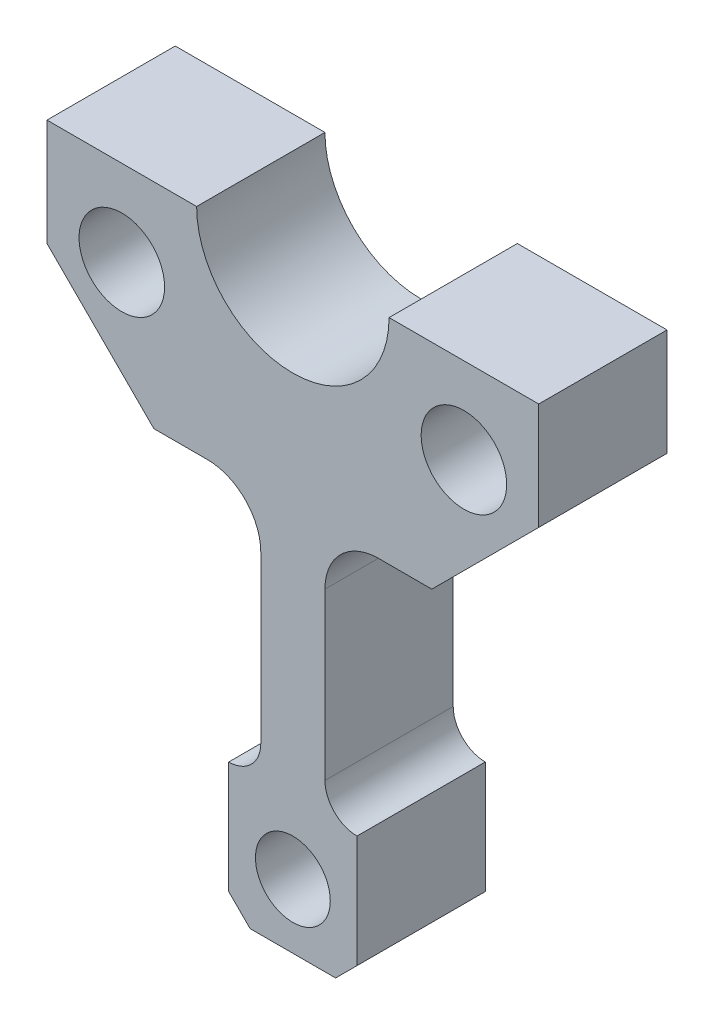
ISO-10303-21;
HEADER;
FILE_DESCRIPTION(('STEP AP214'),'2;1');
FILE_NAME('part.step','',(''),(''),'','','');
FILE_SCHEMA(('AUTOMOTIVE_DESIGN { 1 0 10303 214 1 1 1 1 }'));
ENDSEC;
DATA;
#1=APPLICATION_CONTEXT('core data for automotive mechanical design processes');
#2=APPLICATION_PROTOCOL_DEFINITION('international standard','automotive_design',2000,#1);
#3=PRODUCT_CONTEXT('',#1,'mechanical');
#4=PRODUCT('Part','Part','',(#3));
#5=PRODUCT_RELATED_PRODUCT_CATEGORY('part','',(#4));
#6=PRODUCT_DEFINITION_FORMATION('','',#4);
#7=PRODUCT_DEFINITION_CONTEXT('part definition',#1,'design');
#8=PRODUCT_DEFINITION('design','',#6,#7);
#9=PRODUCT_DEFINITION_SHAPE('','',#8);
#10=(LENGTH_UNIT() NAMED_UNIT(*) SI_UNIT(.MILLI.,.METRE.));
#11=(NAMED_UNIT(*) PLANE_ANGLE_UNIT() SI_UNIT($,.RADIAN.));
#12=(NAMED_UNIT(*) SI_UNIT($,.STERADIAN.) SOLID_ANGLE_UNIT());
#13=UNCERTAINTY_MEASURE_WITH_UNIT(LENGTH_MEASURE(1.E-05),#10,'distance_accuracy_value','');
#14=(GEOMETRIC_REPRESENTATION_CONTEXT(3) GLOBAL_UNCERTAINTY_ASSIGNED_CONTEXT((#13)) GLOBAL_UNIT_ASSIGNED_CONTEXT((#10,
#11,#12)) REPRESENTATION_CONTEXT('',''));
#15=CARTESIAN_POINT('',(0.,0.,0.));
#16=DIRECTION('',(0.,0.,1.));
#17=DIRECTION('',(1.,0.,0.));
#18=AXIS2_PLACEMENT_3D('',#15,#16,#17);
#19=CARTESIAN_POINT('',(-6.00000000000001,-20.,12.));
#20=DIRECTION('',(0.,0.,-1.));
#21=DIRECTION('',(-1.,0.,0.));
#22=AXIS2_PLACEMENT_3D('',#19,#20,#21);
#23=PLANE('',#22);
#24=CARTESIAN_POINT('',(0.,-50.,12.));
#25=DIRECTION('',(0.,0.,1.));
#26=DIRECTION('',(1.,0.,0.));
#27=AXIS2_PLACEMENT_3D('',#24,#25,#26);
#28=CIRCLE('',#27,3.5);
#29=CARTESIAN_POINT('',(3.5,-50.,12.));
#30=VERTEX_POINT('',#29);
#31=EDGE_CURVE('E378',#30,#30,#28,.T.);
#32=ORIENTED_EDGE('',*,*,#31,.F.);
#33=EDGE_LOOP('',(#32));
#34=FACE_BOUND('',#33,.T.);
#35=DIRECTION('',(1.,0.,0.));
#36=VECTOR('',#35,1.);
#37=CARTESIAN_POINT('',(6.00000000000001,-56.,12.));
#38=LINE('',#37,#36);
#39=CARTESIAN_POINT('',(-3.99999999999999,-56.,12.));
#40=VERTEX_POINT('',#39);
#41=CARTESIAN_POINT('',(4.00000000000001,-56.,12.));
#42=VERTEX_POINT('',#41);
#43=EDGE_CURVE('E222',#40,#42,#38,.T.);
#44=ORIENTED_EDGE('',*,*,#43,.T.);
#45=DIRECTION('',(-0.707106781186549,-0.707106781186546,0.));
#46=VECTOR('',#45,1.);
#47=CARTESIAN_POINT('',(6.00000000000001,-54.,12.));
#48=LINE('',#47,#46);
#49=CARTESIAN_POINT('',(6.00000000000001,-54.,12.));
#50=VERTEX_POINT('',#49);
#51=EDGE_CURVE('E47',#42,#50,#48,.F.);
#52=ORIENTED_EDGE('',*,*,#51,.T.);
#53=DIRECTION('',(0.,1.,0.));
#54=VECTOR('',#53,1.);
#55=CARTESIAN_POINT('',(6.00000000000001,-43.5,12.));
#56=LINE('',#55,#54);
#57=CARTESIAN_POINT('',(6.00000000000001,-43.5,12.));
#58=VERTEX_POINT('',#57);
#59=EDGE_CURVE('E224',#50,#58,#56,.T.);
#60=ORIENTED_EDGE('',*,*,#59,.T.);
#61=CARTESIAN_POINT('',(6.00000000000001,-40.5,12.));
#62=DIRECTION('',(0.,0.,-1.));
#63=DIRECTION('',(-1.,0.,0.));
#64=AXIS2_PLACEMENT_3D('',#61,#62,#63);
#65=CIRCLE('',#64,3.);
#66=CARTESIAN_POINT('',(3.,-40.5,12.));
#67=VERTEX_POINT('',#66);
#68=EDGE_CURVE('E306',#58,#67,#65,.T.);
#69=ORIENTED_EDGE('',*,*,#68,.T.);
#70=DIRECTION('',(0.,1.,0.));
#71=VECTOR('',#70,1.);
#72=CARTESIAN_POINT('',(3.,-20.,12.));
#73=LINE('',#72,#71);
#74=CARTESIAN_POINT('',(3.,-25.,12.));
#75=VERTEX_POINT('',#74);
#76=EDGE_CURVE('E226',#67,#75,#73,.T.);
#77=ORIENTED_EDGE('',*,*,#76,.T.);
#78=CARTESIAN_POINT('',(8.,-25.,12.));
#79=DIRECTION('',(0.,0.,-1.));
#80=DIRECTION('',(-1.,0.,0.));
#81=AXIS2_PLACEMENT_3D('',#78,#79,#80);
#82=CIRCLE('',#81,5.);
#83=CARTESIAN_POINT('',(8.,-20.,12.));
#84=VERTEX_POINT('',#83);
#85=EDGE_CURVE('E298',#75,#84,#82,.T.);
#86=ORIENTED_EDGE('',*,*,#85,.T.);
#87=DIRECTION('',(1.,0.,0.));
#88=VECTOR('',#87,1.);
#89=CARTESIAN_POINT('',(23.,-20.,12.));
#90=LINE('',#89,#88);
#91=CARTESIAN_POINT('',(13.,-20.,12.));
#92=VERTEX_POINT('',#91);
#93=EDGE_CURVE('E228',#84,#92,#90,.T.);
#94=ORIENTED_EDGE('',*,*,#93,.T.);
#95=DIRECTION('',(-0.707106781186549,-0.707106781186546,0.));
#96=VECTOR('',#95,1.);
#97=CARTESIAN_POINT('',(23.,-10.,12.));
#98=LINE('',#97,#96);
#99=CARTESIAN_POINT('',(23.,-10.,12.));
#100=VERTEX_POINT('',#99);
#101=EDGE_CURVE('E189',#92,#100,#98,.F.);
#102=ORIENTED_EDGE('',*,*,#101,.T.);
#103=DIRECTION('',(0.,1.,0.));
#104=VECTOR('',#103,1.);
#105=CARTESIAN_POINT('',(23.,0.,12.));
#106=LINE('',#105,#104);
#107=CARTESIAN_POINT('',(23.,0.,12.));
#108=VERTEX_POINT('',#107);
#109=EDGE_CURVE('E230',#100,#108,#106,.T.);
#110=ORIENTED_EDGE('',*,*,#109,.T.);
#111=DIRECTION('',(-1.,0.,0.));
#112=VECTOR('',#111,1.);
#113=CARTESIAN_POINT('',(-23.,0.,12.));
#114=LINE('',#113,#112);
#115=CARTESIAN_POINT('',(9.,0.,12.));
#116=VERTEX_POINT('',#115);
#117=EDGE_CURVE('E231',#108,#116,#114,.T.);
#118=ORIENTED_EDGE('',*,*,#117,.T.);
#119=CARTESIAN_POINT('',(0.,0.,12.));
#120=DIRECTION('',(0.,0.,1.));
#121=DIRECTION('',(1.,0.,0.));
#122=AXIS2_PLACEMENT_3D('',#119,#120,#121);
#123=CIRCLE('',#122,9.);
#124=CARTESIAN_POINT('',(-9.,0.,12.));
#125=VERTEX_POINT('',#124);
#126=EDGE_CURVE('E198',#125,#116,#123,.T.);
#127=ORIENTED_EDGE('',*,*,#126,.F.);
#128=CARTESIAN_POINT('',(-23.,0.,12.));
#129=VERTEX_POINT('',#128);
#130=EDGE_CURVE('E197',#125,#129,#114,.T.);
#131=ORIENTED_EDGE('',*,*,#130,.T.);
#132=DIRECTION('',(0.,-1.,0.));
#133=VECTOR('',#132,1.);
#134=CARTESIAN_POINT('',(-23.,0.,12.));
#135=LINE('',#134,#133);
#136=CARTESIAN_POINT('',(-23.,-9.99999999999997,12.));
#137=VERTEX_POINT('',#136);
#138=EDGE_CURVE('E236',#129,#137,#135,.T.);
#139=ORIENTED_EDGE('',*,*,#138,.T.);
#140=DIRECTION('',(-0.707106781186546,0.707106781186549,0.));
#141=VECTOR('',#140,1.);
#142=CARTESIAN_POINT('',(-13.,-20.,12.));
#143=LINE('',#142,#141);
#144=CARTESIAN_POINT('',(-13.,-20.,12.));
#145=VERTEX_POINT('',#144);
#146=EDGE_CURVE('E263',#137,#145,#143,.F.);
#147=ORIENTED_EDGE('',*,*,#146,.T.);
#148=DIRECTION('',(1.,0.,0.));
#149=VECTOR('',#148,1.);
#150=CARTESIAN_POINT('',(-23.,-20.,12.));
#151=LINE('',#150,#149);
#152=CARTESIAN_POINT('',(-8.,-20.,12.));
#153=VERTEX_POINT('',#152);
#154=EDGE_CURVE('E239',#145,#153,#151,.T.);
#155=ORIENTED_EDGE('',*,*,#154,.T.);
#156=CARTESIAN_POINT('',(-8.,-25.,12.));
#157=DIRECTION('',(0.,0.,-1.));
#158=DIRECTION('',(-1.,0.,0.));
#159=AXIS2_PLACEMENT_3D('',#156,#157,#158);
#160=CIRCLE('',#159,5.);
#161=CARTESIAN_POINT('',(-3.,-25.,12.));
#162=VERTEX_POINT('',#161);
#163=EDGE_CURVE('E281',#153,#162,#160,.T.);
#164=ORIENTED_EDGE('',*,*,#163,.T.);
#165=DIRECTION('',(0.,-1.,0.));
#166=VECTOR('',#165,1.);
#167=CARTESIAN_POINT('',(-3.,-20.,12.));
#168=LINE('',#167,#166);
#169=CARTESIAN_POINT('',(-3.,-40.5,12.));
#170=VERTEX_POINT('',#169);
#171=EDGE_CURVE('E242',#162,#170,#168,.T.);
#172=ORIENTED_EDGE('',*,*,#171,.T.);
#173=CARTESIAN_POINT('',(-5.99999999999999,-40.5,12.));
#174=DIRECTION('',(0.,0.,-1.));
#175=DIRECTION('',(-1.,0.,0.));
#176=AXIS2_PLACEMENT_3D('',#173,#174,#175);
#177=CIRCLE('',#176,3.);
#178=CARTESIAN_POINT('',(-6.,-43.5,12.));
#179=VERTEX_POINT('',#178);
#180=EDGE_CURVE('E287',#170,#179,#177,.T.);
#181=ORIENTED_EDGE('',*,*,#180,.T.);
#182=DIRECTION('',(0.,-1.,0.));
#183=VECTOR('',#182,1.);
#184=CARTESIAN_POINT('',(-6.,-43.5,12.));
#185=LINE('',#184,#183);
#186=CARTESIAN_POINT('',(-6.,-54.,12.));
#187=VERTEX_POINT('',#186);
#188=EDGE_CURVE('E220',#179,#187,#185,.T.);
#189=ORIENTED_EDGE('',*,*,#188,.T.);
#190=DIRECTION('',(-0.707106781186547,0.707106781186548,0.));
#191=VECTOR('',#190,1.);
#192=CARTESIAN_POINT('',(-3.99999999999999,-56.,12.));
#193=LINE('',#192,#191);
#194=EDGE_CURVE('E319',#187,#40,#193,.F.);
#195=ORIENTED_EDGE('',*,*,#194,.T.);
#196=EDGE_LOOP('',(#44,#52,#60,#69,#77,#86,#94,#102,#110,#118,#127,#131,#139,#147,#155,#164,
#172,#181,#189,#195));
#197=FACE_BOUND('',#196,.T.);
#198=CARTESIAN_POINT('',(-15.9997614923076,-8.02605956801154,12.));
#199=DIRECTION('',(0.,0.,1.));
#200=DIRECTION('',(1.,0.,0.));
#201=AXIS2_PLACEMENT_3D('',#198,#199,#200);
#202=CIRCLE('',#201,4.);
#203=CARTESIAN_POINT('',(-11.9997614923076,-8.02605956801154,12.));
#204=VERTEX_POINT('',#203);
#205=EDGE_CURVE('E364',#204,#204,#202,.T.);
#206=ORIENTED_EDGE('',*,*,#205,.F.);
#207=EDGE_LOOP('',(#206));
#208=FACE_BOUND('',#207,.T.);
#209=CARTESIAN_POINT('',(15.9997614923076,-8.02605956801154,12.));
#210=DIRECTION('',(0.,0.,-1.));
#211=DIRECTION('',(-1.,0.,0.));
#212=AXIS2_PLACEMENT_3D('',#209,#210,#211);
#213=CIRCLE('',#212,4.);
#214=CARTESIAN_POINT('',(11.9997614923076,-8.02605956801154,12.));
#215=VERTEX_POINT('',#214);
#216=EDGE_CURVE('E372',#215,#215,#213,.T.);
#217=ORIENTED_EDGE('',*,*,#216,.T.);
#218=EDGE_LOOP('',(#217));
#219=FACE_BOUND('',#218,.T.);
#220=ADVANCED_FACE('F39',(#34,#197,#208,#219),#23,.F.);
#221=CARTESIAN_POINT('',(-6.00000000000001,-20.,0.));
#222=DIRECTION('',(0.,0.,-1.));
#223=DIRECTION('',(-1.,0.,0.));
#224=AXIS2_PLACEMENT_3D('',#221,#222,#223);
#225=PLANE('',#224);
#226=CARTESIAN_POINT('',(0.,-50.,0.));
#227=DIRECTION('',(0.,0.,1.));
#228=DIRECTION('',(1.,0.,0.));
#229=AXIS2_PLACEMENT_3D('',#226,#227,#228);
#230=CIRCLE('',#229,3.5);
#231=CARTESIAN_POINT('',(3.5,-50.,0.));
#232=VERTEX_POINT('',#231);
#233=EDGE_CURVE('E375',#232,#232,#230,.T.);
#234=ORIENTED_EDGE('',*,*,#233,.T.);
#235=EDGE_LOOP('',(#234));
#236=FACE_BOUND('',#235,.T.);
#237=DIRECTION('',(0.,1.,0.));
#238=VECTOR('',#237,1.);
#239=CARTESIAN_POINT('',(6.00000000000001,-43.5,0.));
#240=LINE('',#239,#238);
#241=CARTESIAN_POINT('',(6.00000000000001,-54.,0.));
#242=VERTEX_POINT('',#241);
#243=CARTESIAN_POINT('',(6.00000000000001,-43.5,0.));
#244=VERTEX_POINT('',#243);
#245=EDGE_CURVE('E333',#242,#244,#240,.T.);
#246=ORIENTED_EDGE('',*,*,#245,.F.);
#247=DIRECTION('',(0.707106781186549,0.707106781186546,0.));
#248=VECTOR('',#247,1.);
#249=CARTESIAN_POINT('',(17.,-43.0000000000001,0.));
#250=LINE('',#249,#248);
#251=CARTESIAN_POINT('',(4.00000000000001,-56.,0.));
#252=VERTEX_POINT('',#251);
#253=EDGE_CURVE('E313',#242,#252,#250,.F.);
#254=ORIENTED_EDGE('',*,*,#253,.T.);
#255=DIRECTION('',(1.,0.,0.));
#256=VECTOR('',#255,1.);
#257=CARTESIAN_POINT('',(6.00000000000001,-56.,0.));
#258=LINE('',#257,#256);
#259=CARTESIAN_POINT('',(-3.99999999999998,-56.,0.));
#260=VERTEX_POINT('',#259);
#261=EDGE_CURVE('E332',#260,#252,#258,.T.);
#262=ORIENTED_EDGE('',*,*,#261,.F.);
#263=DIRECTION('',(0.707106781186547,-0.707106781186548,0.));
#264=VECTOR('',#263,1.);
#265=CARTESIAN_POINT('',(-23.,-37.,0.));
#266=LINE('',#265,#264);
#267=CARTESIAN_POINT('',(-6.,-54.,0.));
#268=VERTEX_POINT('',#267);
#269=EDGE_CURVE('E311',#260,#268,#266,.F.);
#270=ORIENTED_EDGE('',*,*,#269,.T.);
#271=DIRECTION('',(0.,-1.,0.));
#272=VECTOR('',#271,1.);
#273=CARTESIAN_POINT('',(-6.,-43.5,0.));
#274=LINE('',#273,#272);
#275=CARTESIAN_POINT('',(-6.,-43.5,0.));
#276=VERTEX_POINT('',#275);
#277=EDGE_CURVE('E336',#276,#268,#274,.T.);
#278=ORIENTED_EDGE('',*,*,#277,.F.);
#279=CARTESIAN_POINT('',(-5.99999999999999,-40.5,0.));
#280=DIRECTION('',(0.,0.,-1.));
#281=DIRECTION('',(-1.,0.,0.));
#282=AXIS2_PLACEMENT_3D('',#279,#280,#281);
#283=CIRCLE('',#282,3.);
#284=CARTESIAN_POINT('',(-3.,-40.5,0.));
#285=VERTEX_POINT('',#284);
#286=EDGE_CURVE('E285',#276,#285,#283,.F.);
#287=ORIENTED_EDGE('',*,*,#286,.T.);
#288=DIRECTION('',(0.,-1.,0.));
#289=VECTOR('',#288,1.);
#290=CARTESIAN_POINT('',(-3.,-20.,0.));
#291=LINE('',#290,#289);
#292=CARTESIAN_POINT('',(-3.,-25.,0.));
#293=VERTEX_POINT('',#292);
#294=EDGE_CURVE('E217',#293,#285,#291,.T.);
#295=ORIENTED_EDGE('',*,*,#294,.F.);
#296=CARTESIAN_POINT('',(-8.,-25.,0.));
#297=DIRECTION('',(0.,0.,-1.));
#298=DIRECTION('',(-1.,0.,0.));
#299=AXIS2_PLACEMENT_3D('',#296,#297,#298);
#300=CIRCLE('',#299,5.);
#301=CARTESIAN_POINT('',(-8.,-20.,0.));
#302=VERTEX_POINT('',#301);
#303=EDGE_CURVE('E279',#293,#302,#300,.F.);
#304=ORIENTED_EDGE('',*,*,#303,.T.);
#305=DIRECTION('',(1.,0.,0.));
#306=VECTOR('',#305,1.);
#307=CARTESIAN_POINT('',(-23.,-20.,0.));
#308=LINE('',#307,#306);
#309=CARTESIAN_POINT('',(-13.,-20.,0.));
#310=VERTEX_POINT('',#309);
#311=EDGE_CURVE('E214',#310,#302,#308,.T.);
#312=ORIENTED_EDGE('',*,*,#311,.F.);
#313=DIRECTION('',(0.707106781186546,-0.707106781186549,0.));
#314=VECTOR('',#313,1.);
#315=CARTESIAN_POINT('',(-9.50000000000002,-23.5,0.));
#316=LINE('',#315,#314);
#317=CARTESIAN_POINT('',(-23.,-9.99999999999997,0.));
#318=VERTEX_POINT('',#317);
#319=EDGE_CURVE('E259',#310,#318,#316,.F.);
#320=ORIENTED_EDGE('',*,*,#319,.T.);
#321=DIRECTION('',(0.,-1.,0.));
#322=VECTOR('',#321,1.);
#323=CARTESIAN_POINT('',(-23.,0.,0.));
#324=LINE('',#323,#322);
#325=CARTESIAN_POINT('',(-23.,0.,0.));
#326=VERTEX_POINT('',#325);
#327=EDGE_CURVE('E205',#326,#318,#324,.T.);
#328=ORIENTED_EDGE('',*,*,#327,.F.);
#329=DIRECTION('',(-1.,0.,0.));
#330=VECTOR('',#329,1.);
#331=CARTESIAN_POINT('',(-23.,0.,0.));
#332=LINE('',#331,#330);
#333=CARTESIAN_POINT('',(-9.,0.,0.));
#334=VERTEX_POINT('',#333);
#335=EDGE_CURVE('E195',#334,#326,#332,.T.);
#336=ORIENTED_EDGE('',*,*,#335,.F.);
#337=CARTESIAN_POINT('',(0.,0.,0.));
#338=DIRECTION('',(0.,0.,-1.));
#339=DIRECTION('',(-1.,0.,0.));
#340=AXIS2_PLACEMENT_3D('',#337,#338,#339);
#341=CIRCLE('',#340,9.);
#342=CARTESIAN_POINT('',(9.,0.,0.));
#343=VERTEX_POINT('',#342);
#344=EDGE_CURVE('E177',#343,#334,#341,.T.);
#345=ORIENTED_EDGE('',*,*,#344,.F.);
#346=CARTESIAN_POINT('',(23.,0.,0.));
#347=VERTEX_POINT('',#346);
#348=EDGE_CURVE('E206',#347,#343,#332,.T.);
#349=ORIENTED_EDGE('',*,*,#348,.F.);
#350=DIRECTION('',(0.,1.,0.));
#351=VECTOR('',#350,1.);
#352=CARTESIAN_POINT('',(23.,0.,0.));
#353=LINE('',#352,#351);
#354=CARTESIAN_POINT('',(23.,-10.,0.));
#355=VERTEX_POINT('',#354);
#356=EDGE_CURVE('E207',#355,#347,#353,.T.);
#357=ORIENTED_EDGE('',*,*,#356,.F.);
#358=DIRECTION('',(0.707106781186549,0.707106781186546,0.));
#359=VECTOR('',#358,1.);
#360=CARTESIAN_POINT('',(3.49999999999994,-29.5,0.));
#361=LINE('',#360,#359);
#362=CARTESIAN_POINT('',(13.,-20.,0.));
#363=VERTEX_POINT('',#362);
#364=EDGE_CURVE('E268',#355,#363,#361,.F.);
#365=ORIENTED_EDGE('',*,*,#364,.T.);
#366=DIRECTION('',(1.,0.,0.));
#367=VECTOR('',#366,1.);
#368=CARTESIAN_POINT('',(23.,-20.,0.));
#369=LINE('',#368,#367);
#370=CARTESIAN_POINT('',(8.,-20.,0.));
#371=VERTEX_POINT('',#370);
#372=EDGE_CURVE('E209',#371,#363,#369,.T.);
#373=ORIENTED_EDGE('',*,*,#372,.F.);
#374=CARTESIAN_POINT('',(8.,-25.,0.));
#375=DIRECTION('',(0.,0.,-1.));
#376=DIRECTION('',(-1.,0.,0.));
#377=AXIS2_PLACEMENT_3D('',#374,#375,#376);
#378=CIRCLE('',#377,5.);
#379=CARTESIAN_POINT('',(3.,-25.,0.));
#380=VERTEX_POINT('',#379);
#381=EDGE_CURVE('E295',#371,#380,#378,.F.);
#382=ORIENTED_EDGE('',*,*,#381,.T.);
#383=DIRECTION('',(0.,1.,0.));
#384=VECTOR('',#383,1.);
#385=CARTESIAN_POINT('',(3.,-20.,0.));
#386=LINE('',#385,#384);
#387=CARTESIAN_POINT('',(3.,-40.5,0.));
#388=VERTEX_POINT('',#387);
#389=EDGE_CURVE('E338',#388,#380,#386,.T.);
#390=ORIENTED_EDGE('',*,*,#389,.F.);
#391=CARTESIAN_POINT('',(6.00000000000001,-40.5,0.));
#392=DIRECTION('',(0.,0.,-1.));
#393=DIRECTION('',(-1.,0.,0.));
#394=AXIS2_PLACEMENT_3D('',#391,#392,#393);
#395=CIRCLE('',#394,3.);
#396=EDGE_CURVE('E303',#388,#244,#395,.F.);
#397=ORIENTED_EDGE('',*,*,#396,.T.);
#398=EDGE_LOOP('',(#246,#254,#262,#270,#278,#287,#295,#304,#312,#320,#328,#336,#345,#349,#357,
#365,#373,#382,#390,#397));
#399=FACE_BOUND('',#398,.T.);
#400=CARTESIAN_POINT('',(-15.9997614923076,-8.02605956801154,0.));
#401=DIRECTION('',(0.,0.,1.));
#402=DIRECTION('',(1.,0.,0.));
#403=AXIS2_PLACEMENT_3D('',#400,#401,#402);
#404=CIRCLE('',#403,4.);
#405=CARTESIAN_POINT('',(-11.9997614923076,-8.02605956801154,0.));
#406=VERTEX_POINT('',#405);
#407=EDGE_CURVE('E361',#406,#406,#404,.T.);
#408=ORIENTED_EDGE('',*,*,#407,.T.);
#409=EDGE_LOOP('',(#408));
#410=FACE_BOUND('',#409,.T.);
#411=CARTESIAN_POINT('',(15.9997614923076,-8.02605956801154,0.));
#412=DIRECTION('',(0.,0.,-1.));
#413=DIRECTION('',(-1.,0.,0.));
#414=AXIS2_PLACEMENT_3D('',#411,#412,#413);
#415=CIRCLE('',#414,4.);
#416=CARTESIAN_POINT('',(11.9997614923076,-8.02605956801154,0.));
#417=VERTEX_POINT('',#416);
#418=EDGE_CURVE('E369',#417,#417,#415,.T.);
#419=ORIENTED_EDGE('',*,*,#418,.F.);
#420=EDGE_LOOP('',(#419));
#421=FACE_BOUND('',#420,.T.);
#422=ADVANCED_FACE('F202',(#236,#399,#410,#421),#225,.T.);
#423=CARTESIAN_POINT('',(-23.,0.,12.));
#424=DIRECTION('',(0.,-1.,0.));
#425=DIRECTION('',(1.,0.,0.));
#426=AXIS2_PLACEMENT_3D('',#423,#424,#425);
#427=PLANE('',#426);
#428=ORIENTED_EDGE('',*,*,#348,.T.);
#429=DIRECTION('',(0.,0.,1.));
#430=VECTOR('',#429,1.);
#431=CARTESIAN_POINT('',(9.,0.,0.));
#432=LINE('',#431,#430);
#433=EDGE_CURVE('E183',#343,#116,#432,.T.);
#434=ORIENTED_EDGE('',*,*,#433,.T.);
#435=ORIENTED_EDGE('',*,*,#117,.F.);
#436=DIRECTION('',(0.,0.,-1.));
#437=VECTOR('',#436,1.);
#438=CARTESIAN_POINT('',(23.,0.,12.));
#439=LINE('',#438,#437);
#440=EDGE_CURVE('E250',#108,#347,#439,.T.);
#441=ORIENTED_EDGE('',*,*,#440,.T.);
#442=EDGE_LOOP('',(#428,#434,#435,#441));
#443=FACE_BOUND('',#442,.T.);
#444=ADVANCED_FACE('F360',(#443),#427,.F.);
#445=CARTESIAN_POINT('',(-6.,-43.5,12.));
#446=DIRECTION('',(1.,0.,0.));
#447=DIRECTION('',(0.,1.,0.));
#448=AXIS2_PLACEMENT_3D('',#445,#446,#447);
#449=PLANE('',#448);
#450=ORIENTED_EDGE('',*,*,#277,.T.);
#451=DIRECTION('',(0.,0.,1.));
#452=VECTOR('',#451,1.);
#453=CARTESIAN_POINT('',(-6.,-54.,12.));
#454=LINE('',#453,#452);
#455=EDGE_CURVE('E12',#268,#187,#454,.T.);
#456=ORIENTED_EDGE('',*,*,#455,.T.);
#457=ORIENTED_EDGE('',*,*,#188,.F.);
#458=DIRECTION('',(0.,0.,-1.));
#459=VECTOR('',#458,1.);
#460=CARTESIAN_POINT('',(-6.,-43.5,12.));
#461=LINE('',#460,#459);
#462=EDGE_CURVE('E245',#179,#276,#461,.T.);
#463=ORIENTED_EDGE('',*,*,#462,.T.);
#464=EDGE_LOOP('',(#450,#456,#457,#463));
#465=FACE_BOUND('',#464,.T.);
#466=ADVANCED_FACE('F41',(#465),#449,.F.);
#467=CARTESIAN_POINT('',(6.00000000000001,-56.,12.));
#468=DIRECTION('',(0.,1.,0.));
#469=DIRECTION('',(0.,0.,1.));
#470=AXIS2_PLACEMENT_3D('',#467,#468,#469);
#471=PLANE('',#470);
#472=ORIENTED_EDGE('',*,*,#261,.T.);
#473=DIRECTION('',(0.,0.,1.));
#474=VECTOR('',#473,1.);
#475=CARTESIAN_POINT('',(4.00000000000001,-56.,12.));
#476=LINE('',#475,#474);
#477=EDGE_CURVE('E60',#252,#42,#476,.T.);
#478=ORIENTED_EDGE('',*,*,#477,.T.);
#479=ORIENTED_EDGE('',*,*,#43,.F.);
#480=DIRECTION('',(0.,0.,-1.));
#481=VECTOR('',#480,1.);
#482=CARTESIAN_POINT('',(-3.99999999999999,-56.,12.));
#483=LINE('',#482,#481);
#484=EDGE_CURVE('E315',#40,#260,#483,.T.);
#485=ORIENTED_EDGE('',*,*,#484,.T.);
#486=EDGE_LOOP('',(#472,#478,#479,#485));
#487=FACE_BOUND('',#486,.T.);
#488=ADVANCED_FACE('F334',(#487),#471,.F.);
#489=CARTESIAN_POINT('',(6.00000000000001,-43.5,12.));
#490=DIRECTION('',(-1.,0.,0.));
#491=DIRECTION('',(0.,-1.,0.));
#492=AXIS2_PLACEMENT_3D('',#489,#490,#491);
#493=PLANE('',#492);
#494=ORIENTED_EDGE('',*,*,#59,.F.);
#495=DIRECTION('',(0.,0.,-1.));
#496=VECTOR('',#495,1.);
#497=CARTESIAN_POINT('',(6.00000000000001,-54.,12.));
#498=LINE('',#497,#496);
#499=EDGE_CURVE('E308',#50,#242,#498,.T.);
#500=ORIENTED_EDGE('',*,*,#499,.T.);
#501=ORIENTED_EDGE('',*,*,#245,.T.);
#502=DIRECTION('',(0.,0.,-1.));
#503=VECTOR('',#502,1.);
#504=CARTESIAN_POINT('',(6.00000000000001,-43.5,12.));
#505=LINE('',#504,#503);
#506=EDGE_CURVE('E253',#58,#244,#505,.T.);
#507=ORIENTED_EDGE('',*,*,#506,.F.);
#508=EDGE_LOOP('',(#494,#500,#501,#507));
#509=FACE_BOUND('',#508,.T.);
#510=ADVANCED_FACE('F328',(#509),#493,.F.);
#511=CARTESIAN_POINT('',(3.,-20.,12.));
#512=DIRECTION('',(-1.,0.,0.));
#513=DIRECTION('',(0.,-1.,0.));
#514=AXIS2_PLACEMENT_3D('',#511,#512,#513);
#515=PLANE('',#514);
#516=ORIENTED_EDGE('',*,*,#76,.F.);
#517=DIRECTION('',(0.,0.,-1.));
#518=VECTOR('',#517,1.);
#519=CARTESIAN_POINT('',(3.,-40.5,0.));
#520=LINE('',#519,#518);
#521=EDGE_CURVE('E300',#67,#388,#520,.T.);
#522=ORIENTED_EDGE('',*,*,#521,.T.);
#523=ORIENTED_EDGE('',*,*,#389,.T.);
#524=DIRECTION('',(0.,0.,-1.));
#525=VECTOR('',#524,1.);
#526=CARTESIAN_POINT('',(3.,-25.,12.));
#527=LINE('',#526,#525);
#528=EDGE_CURVE('E292',#380,#75,#527,.F.);
#529=ORIENTED_EDGE('',*,*,#528,.T.);
#530=EDGE_LOOP('',(#516,#522,#523,#529));
#531=FACE_BOUND('',#530,.T.);
#532=ADVANCED_FACE('F412',(#531),#515,.F.);
#533=CARTESIAN_POINT('',(23.,-20.,12.));
#534=DIRECTION('',(0.,1.,0.));
#535=DIRECTION('',(-1.,0.,0.));
#536=AXIS2_PLACEMENT_3D('',#533,#534,#535);
#537=PLANE('',#536);
#538=ORIENTED_EDGE('',*,*,#93,.F.);
#539=DIRECTION('',(0.,0.,-1.));
#540=VECTOR('',#539,1.);
#541=CARTESIAN_POINT('',(8.,-20.,0.));
#542=LINE('',#541,#540);
#543=EDGE_CURVE('E289',#84,#371,#542,.T.);
#544=ORIENTED_EDGE('',*,*,#543,.T.);
#545=ORIENTED_EDGE('',*,*,#372,.T.);
#546=DIRECTION('',(0.,0.,1.));
#547=VECTOR('',#546,1.);
#548=CARTESIAN_POINT('',(13.,-20.,12.));
#549=LINE('',#548,#547);
#550=EDGE_CURVE('E271',#363,#92,#549,.T.);
#551=ORIENTED_EDGE('',*,*,#550,.T.);
#552=EDGE_LOOP('',(#538,#544,#545,#551));
#553=FACE_BOUND('',#552,.T.);
#554=ADVANCED_FACE('F346',(#553),#537,.F.);
#555=CARTESIAN_POINT('',(23.,0.,12.));
#556=DIRECTION('',(-1.,0.,0.));
#557=DIRECTION('',(0.,-1.,0.));
#558=AXIS2_PLACEMENT_3D('',#555,#556,#557);
#559=PLANE('',#558);
#560=ORIENTED_EDGE('',*,*,#109,.F.);
#561=DIRECTION('',(0.,0.,-1.));
#562=VECTOR('',#561,1.);
#563=CARTESIAN_POINT('',(23.,-10.,12.));
#564=LINE('',#563,#562);
#565=EDGE_CURVE('E265',#100,#355,#564,.T.);
#566=ORIENTED_EDGE('',*,*,#565,.T.);
#567=ORIENTED_EDGE('',*,*,#356,.T.);
#568=ORIENTED_EDGE('',*,*,#440,.F.);
#569=EDGE_LOOP('',(#560,#566,#567,#568));
#570=FACE_BOUND('',#569,.T.);
#571=ADVANCED_FACE('F357',(#570),#559,.F.);
#572=ORIENTED_EDGE('',*,*,#130,.F.);
#573=DIRECTION('',(0.,0.,1.));
#574=VECTOR('',#573,1.);
#575=CARTESIAN_POINT('',(-9.,0.,0.));
#576=LINE('',#575,#574);
#577=EDGE_CURVE('E180',#125,#334,#576,.F.);
#578=ORIENTED_EDGE('',*,*,#577,.T.);
#579=ORIENTED_EDGE('',*,*,#335,.T.);
#580=DIRECTION('',(0.,0.,-1.));
#581=VECTOR('',#580,1.);
#582=CARTESIAN_POINT('',(-23.,0.,12.));
#583=LINE('',#582,#581);
#584=EDGE_CURVE('E248',#129,#326,#583,.T.);
#585=ORIENTED_EDGE('',*,*,#584,.F.);
#586=EDGE_LOOP('',(#572,#578,#579,#585));
#587=FACE_BOUND('',#586,.T.);
#588=ADVANCED_FACE('F193',(#587),#427,.F.);
#589=CARTESIAN_POINT('',(-23.,0.,12.));
#590=DIRECTION('',(1.,0.,0.));
#591=DIRECTION('',(0.,1.,0.));
#592=AXIS2_PLACEMENT_3D('',#589,#590,#591);
#593=PLANE('',#592);
#594=ORIENTED_EDGE('',*,*,#327,.T.);
#595=DIRECTION('',(0.,0.,1.));
#596=VECTOR('',#595,1.);
#597=CARTESIAN_POINT('',(-23.,-9.99999999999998,12.));
#598=LINE('',#597,#596);
#599=EDGE_CURVE('E261',#318,#137,#598,.T.);
#600=ORIENTED_EDGE('',*,*,#599,.T.);
#601=ORIENTED_EDGE('',*,*,#138,.F.);
#602=ORIENTED_EDGE('',*,*,#584,.T.);
#603=EDGE_LOOP('',(#594,#600,#601,#602));
#604=FACE_BOUND('',#603,.T.);
#605=ADVANCED_FACE('F401',(#604),#593,.F.);
#606=CARTESIAN_POINT('',(-23.,-20.,12.));
#607=DIRECTION('',(0.,1.,0.));
#608=DIRECTION('',(-1.,0.,0.));
#609=AXIS2_PLACEMENT_3D('',#606,#607,#608);
#610=PLANE('',#609);
#611=ORIENTED_EDGE('',*,*,#311,.T.);
#612=DIRECTION('',(0.,0.,-1.));
#613=VECTOR('',#612,1.);
#614=CARTESIAN_POINT('',(-8.,-20.,12.));
#615=LINE('',#614,#613);
#616=EDGE_CURVE('E277',#302,#153,#615,.F.);
#617=ORIENTED_EDGE('',*,*,#616,.T.);
#618=ORIENTED_EDGE('',*,*,#154,.F.);
#619=DIRECTION('',(0.,0.,-1.));
#620=VECTOR('',#619,1.);
#621=CARTESIAN_POINT('',(-13.,-20.,12.));
#622=LINE('',#621,#620);
#623=EDGE_CURVE('E256',#145,#310,#622,.T.);
#624=ORIENTED_EDGE('',*,*,#623,.T.);
#625=EDGE_LOOP('',(#611,#617,#618,#624));
#626=FACE_BOUND('',#625,.T.);
#627=ADVANCED_FACE('F397',(#626),#610,.F.);
#628=CARTESIAN_POINT('',(-3.,-20.,12.));
#629=DIRECTION('',(1.,0.,0.));
#630=DIRECTION('',(0.,1.,0.));
#631=AXIS2_PLACEMENT_3D('',#628,#629,#630);
#632=PLANE('',#631);
#633=ORIENTED_EDGE('',*,*,#294,.T.);
#634=DIRECTION('',(0.,0.,-1.));
#635=VECTOR('',#634,1.);
#636=CARTESIAN_POINT('',(-3.,-40.5,12.));
#637=LINE('',#636,#635);
#638=EDGE_CURVE('E283',#285,#170,#637,.F.);
#639=ORIENTED_EDGE('',*,*,#638,.T.);
#640=ORIENTED_EDGE('',*,*,#171,.F.);
#641=DIRECTION('',(0.,0.,-1.));
#642=VECTOR('',#641,1.);
#643=CARTESIAN_POINT('',(-3.,-25.,0.));
#644=LINE('',#643,#642);
#645=EDGE_CURVE('E188',#162,#293,#644,.T.);
#646=ORIENTED_EDGE('',*,*,#645,.T.);
#647=EDGE_LOOP('',(#633,#639,#640,#646));
#648=FACE_BOUND('',#647,.T.);
#649=ADVANCED_FACE('F393',(#648),#632,.F.);
#650=CARTESIAN_POINT('',(-13.,-20.,12.));
#651=DIRECTION('',(0.707106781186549,0.707106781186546,0.));
#652=DIRECTION('',(-0.707106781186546,0.707106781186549,0.));
#653=AXIS2_PLACEMENT_3D('',#650,#651,#652);
#654=PLANE('',#653);
#655=ORIENTED_EDGE('',*,*,#146,.F.);
#656=ORIENTED_EDGE('',*,*,#599,.F.);
#657=ORIENTED_EDGE('',*,*,#319,.F.);
#658=ORIENTED_EDGE('',*,*,#623,.F.);
#659=EDGE_LOOP('',(#655,#656,#657,#658));
#660=FACE_BOUND('',#659,.T.);
#661=ADVANCED_FACE('F396',(#660),#654,.F.);
#662=CARTESIAN_POINT('',(23.,-10.,12.));
#663=DIRECTION('',(-0.707106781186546,0.707106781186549,0.));
#664=DIRECTION('',(-0.707106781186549,-0.707106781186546,0.));
#665=AXIS2_PLACEMENT_3D('',#662,#663,#664);
#666=PLANE('',#665);
#667=ORIENTED_EDGE('',*,*,#101,.F.);
#668=ORIENTED_EDGE('',*,*,#550,.F.);
#669=ORIENTED_EDGE('',*,*,#364,.F.);
#670=ORIENTED_EDGE('',*,*,#565,.F.);
#671=EDGE_LOOP('',(#667,#668,#669,#670));
#672=FACE_BOUND('',#671,.T.);
#673=ADVANCED_FACE('F353',(#672),#666,.F.);
#674=CARTESIAN_POINT('',(0.,0.,0.));
#675=DIRECTION('',(0.,0.,1.));
#676=DIRECTION('',(1.,0.,0.));
#677=AXIS2_PLACEMENT_3D('',#674,#675,#676);
#678=CYLINDRICAL_SURFACE('',#677,9.);
#679=ORIENTED_EDGE('',*,*,#344,.T.);
#680=ORIENTED_EDGE('',*,*,#577,.F.);
#681=ORIENTED_EDGE('',*,*,#126,.T.);
#682=ORIENTED_EDGE('',*,*,#433,.F.);
#683=EDGE_LOOP('',(#679,#680,#681,#682));
#684=FACE_BOUND('',#683,.T.);
#685=ADVANCED_FACE('F179',(#684),#678,.F.);
#686=CARTESIAN_POINT('',(-8.,-25.,12.));
#687=DIRECTION('',(0.,0.,1.));
#688=DIRECTION('',(1.,0.,0.));
#689=AXIS2_PLACEMENT_3D('',#686,#687,#688);
#690=CYLINDRICAL_SURFACE('',#689,5.);
#691=ORIENTED_EDGE('',*,*,#163,.F.);
#692=ORIENTED_EDGE('',*,*,#616,.F.);
#693=ORIENTED_EDGE('',*,*,#303,.F.);
#694=ORIENTED_EDGE('',*,*,#645,.F.);
#695=EDGE_LOOP('',(#691,#692,#693,#694));
#696=FACE_BOUND('',#695,.T.);
#697=ADVANCED_FACE('F438',(#696),#690,.F.);
#698=CARTESIAN_POINT('',(-5.99999999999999,-40.5,12.));
#699=DIRECTION('',(0.,0.,1.));
#700=DIRECTION('',(1.,0.,0.));
#701=AXIS2_PLACEMENT_3D('',#698,#699,#700);
#702=CYLINDRICAL_SURFACE('',#701,3.);
#703=ORIENTED_EDGE('',*,*,#180,.F.);
#704=ORIENTED_EDGE('',*,*,#638,.F.);
#705=ORIENTED_EDGE('',*,*,#286,.F.);
#706=ORIENTED_EDGE('',*,*,#462,.F.);
#707=EDGE_LOOP('',(#703,#704,#705,#706));
#708=FACE_BOUND('',#707,.T.);
#709=ADVANCED_FACE('F431',(#708),#702,.F.);
#710=CARTESIAN_POINT('',(8.,-25.,12.));
#711=DIRECTION('',(0.,0.,1.));
#712=DIRECTION('',(1.,0.,0.));
#713=AXIS2_PLACEMENT_3D('',#710,#711,#712);
#714=CYLINDRICAL_SURFACE('',#713,5.);
#715=ORIENTED_EDGE('',*,*,#85,.F.);
#716=ORIENTED_EDGE('',*,*,#528,.F.);
#717=ORIENTED_EDGE('',*,*,#381,.F.);
#718=ORIENTED_EDGE('',*,*,#543,.F.);
#719=EDGE_LOOP('',(#715,#716,#717,#718));
#720=FACE_BOUND('',#719,.T.);
#721=ADVANCED_FACE('F459',(#720),#714,.F.);
#722=CARTESIAN_POINT('',(6.00000000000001,-40.5,12.));
#723=DIRECTION('',(0.,0.,1.));
#724=DIRECTION('',(1.,0.,0.));
#725=AXIS2_PLACEMENT_3D('',#722,#723,#724);
#726=CYLINDRICAL_SURFACE('',#725,3.);
#727=ORIENTED_EDGE('',*,*,#68,.F.);
#728=ORIENTED_EDGE('',*,*,#506,.T.);
#729=ORIENTED_EDGE('',*,*,#396,.F.);
#730=ORIENTED_EDGE('',*,*,#521,.F.);
#731=EDGE_LOOP('',(#727,#728,#729,#730));
#732=FACE_BOUND('',#731,.T.);
#733=ADVANCED_FACE('F462',(#732),#726,.F.);
#734=CARTESIAN_POINT('',(6.00000000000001,-54.,12.));
#735=DIRECTION('',(-0.707106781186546,0.707106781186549,0.));
#736=DIRECTION('',(-0.707106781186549,-0.707106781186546,0.));
#737=AXIS2_PLACEMENT_3D('',#734,#735,#736);
#738=PLANE('',#737);
#739=ORIENTED_EDGE('',*,*,#51,.F.);
#740=ORIENTED_EDGE('',*,*,#477,.F.);
#741=ORIENTED_EDGE('',*,*,#253,.F.);
#742=ORIENTED_EDGE('',*,*,#499,.F.);
#743=EDGE_LOOP('',(#739,#740,#741,#742));
#744=FACE_BOUND('',#743,.T.);
#745=ADVANCED_FACE('F330',(#744),#738,.F.);
#746=CARTESIAN_POINT('',(-3.99999999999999,-56.,12.));
#747=DIRECTION('',(0.707106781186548,0.707106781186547,0.));
#748=DIRECTION('',(-0.707106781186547,0.707106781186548,0.));
#749=AXIS2_PLACEMENT_3D('',#746,#747,#748);
#750=PLANE('',#749);
#751=ORIENTED_EDGE('',*,*,#194,.F.);
#752=ORIENTED_EDGE('',*,*,#455,.F.);
#753=ORIENTED_EDGE('',*,*,#269,.F.);
#754=ORIENTED_EDGE('',*,*,#484,.F.);
#755=EDGE_LOOP('',(#751,#752,#753,#754));
#756=FACE_BOUND('',#755,.T.);
#757=ADVANCED_FACE('F428',(#756),#750,.F.);
#758=CARTESIAN_POINT('',(-15.9997614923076,-8.02605956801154,0.));
#759=DIRECTION('',(0.,0.,1.));
#760=DIRECTION('',(1.,0.,0.));
#761=AXIS2_PLACEMENT_3D('',#758,#759,#760);
#762=CYLINDRICAL_SURFACE('',#761,4.);
#763=ORIENTED_EDGE('',*,*,#407,.F.);
#764=EDGE_LOOP('',(#763));
#765=FACE_BOUND('',#764,.T.);
#766=ORIENTED_EDGE('',*,*,#205,.T.);
#767=EDGE_LOOP('',(#766));
#768=FACE_BOUND('',#767,.T.);
#769=ADVANCED_FACE('F471',(#765,#768),#762,.F.);
#770=CARTESIAN_POINT('',(15.9997614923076,-8.02605956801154,0.));
#771=DIRECTION('',(0.,0.,1.));
#772=DIRECTION('',(1.,0.,0.));
#773=AXIS2_PLACEMENT_3D('',#770,#771,#772);
#774=CYLINDRICAL_SURFACE('',#773,4.);
#775=ORIENTED_EDGE('',*,*,#418,.T.);
#776=EDGE_LOOP('',(#775));
#777=FACE_BOUND('',#776,.T.);
#778=ORIENTED_EDGE('',*,*,#216,.F.);
#779=EDGE_LOOP('',(#778));
#780=FACE_BOUND('',#779,.T.);
#781=ADVANCED_FACE('F474',(#777,#780),#774,.F.);
#782=CARTESIAN_POINT('',(0.,-50.,0.));
#783=DIRECTION('',(0.,0.,1.));
#784=DIRECTION('',(1.,0.,0.));
#785=AXIS2_PLACEMENT_3D('',#782,#783,#784);
#786=CYLINDRICAL_SURFACE('',#785,3.5);
#787=ORIENTED_EDGE('',*,*,#233,.F.);
#788=EDGE_LOOP('',(#787));
#789=FACE_BOUND('',#788,.T.);
#790=ORIENTED_EDGE('',*,*,#31,.T.);
#791=EDGE_LOOP('',(#790));
#792=FACE_BOUND('',#791,.T.);
#793=ADVANCED_FACE('F382',(#789,#792),#786,.F.);
#794=CLOSED_SHELL('',(#220,#422,#444,#466,#488,#510,#532,#554,#571,#588,#605,#627,#649,#661,
#673,#685,#697,#709,#721,#733,#745,#757,#769,#781,#793));
#795=MANIFOLD_SOLID_BREP('B2',#794);
#796=ADVANCED_BREP_SHAPE_REPRESENTATION('',(#18,#795),#14);
#797=SHAPE_DEFINITION_REPRESENTATION(#9,#796);
ENDSEC;
END-ISO-10303-21;
